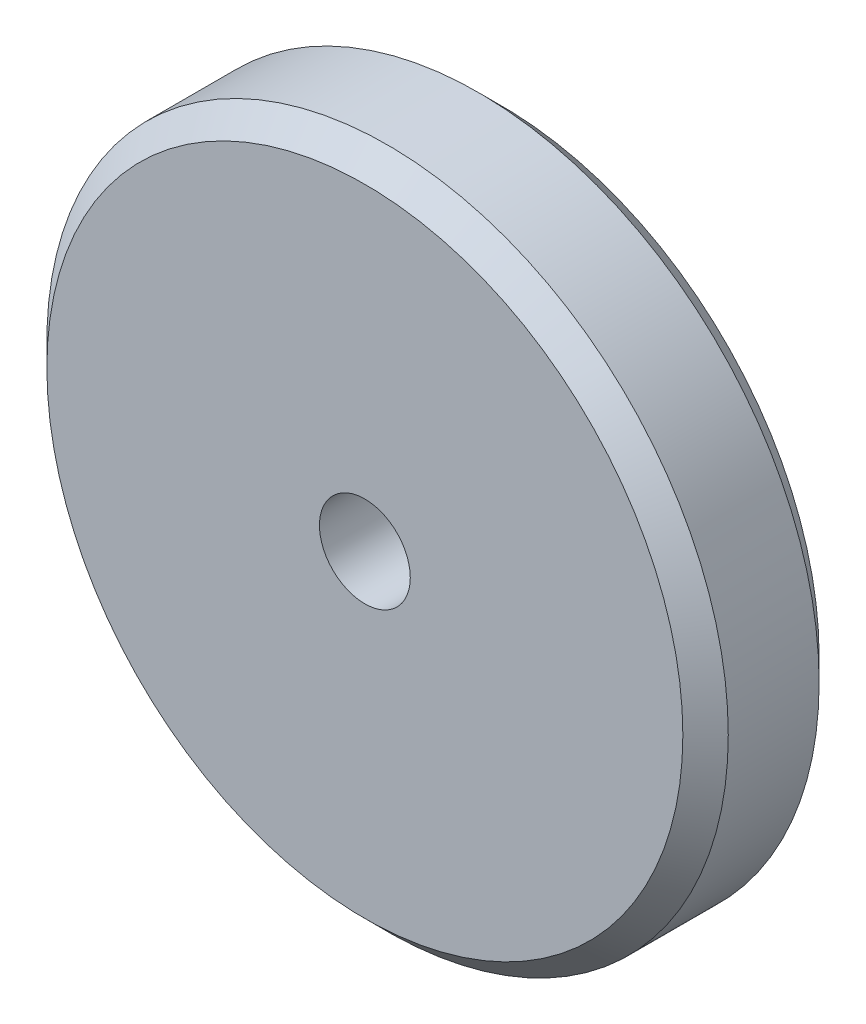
ISO-10303-21;
HEADER;
FILE_DESCRIPTION(('STEP AP214'),'2;1');
FILE_NAME('part.step','',(''),(''),'','','');
FILE_SCHEMA(('AUTOMOTIVE_DESIGN { 1 0 10303 214 1 1 1 1 }'));
ENDSEC;
DATA;
#1=APPLICATION_CONTEXT('core data for automotive mechanical design processes');
#2=APPLICATION_PROTOCOL_DEFINITION('international standard','automotive_design',2000,#1);
#3=PRODUCT_CONTEXT('',#1,'mechanical');
#4=PRODUCT('Part','Part','',(#3));
#5=PRODUCT_RELATED_PRODUCT_CATEGORY('part','',(#4));
#6=PRODUCT_DEFINITION_FORMATION('','',#4);
#7=PRODUCT_DEFINITION_CONTEXT('part definition',#1,'design');
#8=PRODUCT_DEFINITION('design','',#6,#7);
#9=PRODUCT_DEFINITION_SHAPE('','',#8);
#10=(LENGTH_UNIT() NAMED_UNIT(*) SI_UNIT(.MILLI.,.METRE.));
#11=(NAMED_UNIT(*) PLANE_ANGLE_UNIT() SI_UNIT($,.RADIAN.));
#12=(NAMED_UNIT(*) SI_UNIT($,.STERADIAN.) SOLID_ANGLE_UNIT());
#13=UNCERTAINTY_MEASURE_WITH_UNIT(LENGTH_MEASURE(1.E-05),#10,'distance_accuracy_value','');
#14=(GEOMETRIC_REPRESENTATION_CONTEXT(3) GLOBAL_UNCERTAINTY_ASSIGNED_CONTEXT((#13)) GLOBAL_UNIT_ASSIGNED_CONTEXT((#10,
#11,#12)) REPRESENTATION_CONTEXT('',''));
#15=CARTESIAN_POINT('',(0.,0.,0.));
#16=DIRECTION('',(0.,0.,1.));
#17=DIRECTION('',(1.,0.,0.));
#18=AXIS2_PLACEMENT_3D('',#15,#16,#17);
#19=CARTESIAN_POINT('',(0.,0.,6.));
#20=DIRECTION('',(0.,0.,1.));
#21=DIRECTION('',(1.,0.,0.));
#22=AXIS2_PLACEMENT_3D('',#19,#20,#21);
#23=PLANE('',#22);
#24=CARTESIAN_POINT('',(0.,0.,6.));
#25=DIRECTION('',(0.,0.,1.));
#26=DIRECTION('',(1.,0.,0.));
#27=AXIS2_PLACEMENT_3D('',#24,#25,#26);
#28=CIRCLE('',#27,14.);
#29=CARTESIAN_POINT('',(14.,0.,6.));
#30=VERTEX_POINT('',#29);
#31=EDGE_CURVE('E10',#30,#30,#28,.T.);
#32=ORIENTED_EDGE('',*,*,#31,.T.);
#33=EDGE_LOOP('',(#32));
#34=FACE_BOUND('',#33,.T.);
#35=CARTESIAN_POINT('',(0.,0.,6.));
#36=DIRECTION('',(0.,0.,1.));
#37=DIRECTION('',(1.,0.,0.));
#38=AXIS2_PLACEMENT_3D('',#35,#36,#37);
#39=CIRCLE('',#38,2.);
#40=CARTESIAN_POINT('',(2.,0.,6.));
#41=VERTEX_POINT('',#40);
#42=EDGE_CURVE('E52',#41,#41,#39,.T.);
#43=ORIENTED_EDGE('',*,*,#42,.F.);
#44=EDGE_LOOP('',(#43));
#45=FACE_BOUND('',#44,.T.);
#46=ADVANCED_FACE('F32',(#34,#45),#23,.T.);
#47=CARTESIAN_POINT('',(0.,0.,0.));
#48=DIRECTION('',(0.,0.,1.));
#49=DIRECTION('',(1.,0.,0.));
#50=AXIS2_PLACEMENT_3D('',#47,#48,#49);
#51=PLANE('',#50);
#52=CARTESIAN_POINT('',(0.,0.,0.));
#53=DIRECTION('',(0.,0.,1.));
#54=DIRECTION('',(1.,0.,0.));
#55=AXIS2_PLACEMENT_3D('',#52,#53,#54);
#56=CIRCLE('',#55,14.);
#57=CARTESIAN_POINT('',(14.,0.,0.));
#58=VERTEX_POINT('',#57);
#59=EDGE_CURVE('E39',#58,#58,#56,.F.);
#60=ORIENTED_EDGE('',*,*,#59,.T.);
#61=EDGE_LOOP('',(#60));
#62=FACE_BOUND('',#61,.T.);
#63=CARTESIAN_POINT('',(0.,0.,0.));
#64=DIRECTION('',(0.,0.,1.));
#65=DIRECTION('',(1.,0.,0.));
#66=AXIS2_PLACEMENT_3D('',#63,#64,#65);
#67=CIRCLE('',#66,2.);
#68=CARTESIAN_POINT('',(2.,0.,0.));
#69=VERTEX_POINT('',#68);
#70=EDGE_CURVE('E55',#69,#69,#67,.T.);
#71=ORIENTED_EDGE('',*,*,#70,.T.);
#72=EDGE_LOOP('',(#71));
#73=FACE_BOUND('',#72,.T.);
#74=ADVANCED_FACE('F59',(#62,#73),#51,.F.);
#75=CARTESIAN_POINT('',(0.,0.,6.));
#76=DIRECTION('',(0.,0.,-1.));
#77=DIRECTION('',(-1.,0.,0.));
#78=AXIS2_PLACEMENT_3D('',#75,#76,#77);
#79=CYLINDRICAL_SURFACE('',#78,15.);
#80=CARTESIAN_POINT('',(0.,0.,0.999999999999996));
#81=DIRECTION('',(0.,0.,1.));
#82=DIRECTION('',(1.,0.,0.));
#83=AXIS2_PLACEMENT_3D('',#80,#81,#82);
#84=CIRCLE('',#83,15.);
#85=CARTESIAN_POINT('',(15.,0.,0.999999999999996));
#86=VERTEX_POINT('',#85);
#87=EDGE_CURVE('E43',#86,#86,#84,.T.);
#88=ORIENTED_EDGE('',*,*,#87,.T.);
#89=EDGE_LOOP('',(#88));
#90=FACE_BOUND('',#89,.T.);
#91=CARTESIAN_POINT('',(0.,0.,4.99999999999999));
#92=DIRECTION('',(0.,0.,1.));
#93=DIRECTION('',(1.,0.,0.));
#94=AXIS2_PLACEMENT_3D('',#91,#92,#93);
#95=CIRCLE('',#94,15.);
#96=CARTESIAN_POINT('',(15.,0.,4.99999999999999));
#97=VERTEX_POINT('',#96);
#98=EDGE_CURVE('E47',#97,#97,#95,.F.);
#99=ORIENTED_EDGE('',*,*,#98,.T.);
#100=EDGE_LOOP('',(#99));
#101=FACE_BOUND('',#100,.T.);
#102=ADVANCED_FACE('F34',(#90,#101),#79,.T.);
#103=CARTESIAN_POINT('',(0.,0.,6.));
#104=DIRECTION('',(0.,0.,-1.));
#105=DIRECTION('',(-1.,0.,0.));
#106=AXIS2_PLACEMENT_3D('',#103,#104,#105);
#107=CYLINDRICAL_SURFACE('',#106,2.);
#108=ORIENTED_EDGE('',*,*,#42,.T.);
#109=EDGE_LOOP('',(#108));
#110=FACE_BOUND('',#109,.T.);
#111=ORIENTED_EDGE('',*,*,#70,.F.);
#112=EDGE_LOOP('',(#111));
#113=FACE_BOUND('',#112,.T.);
#114=ADVANCED_FACE('F61',(#110,#113),#107,.F.);
#115=CARTESIAN_POINT('',(0.,0.,0.999999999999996));
#116=DIRECTION('',(0.,0.,1.));
#117=DIRECTION('',(1.,0.,0.));
#118=AXIS2_PLACEMENT_3D('',#115,#116,#117);
#119=CONICAL_SURFACE('',#118,15.,0.785398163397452);
#120=ORIENTED_EDGE('',*,*,#59,.F.);
#121=EDGE_LOOP('',(#120));
#122=FACE_BOUND('',#121,.T.);
#123=ORIENTED_EDGE('',*,*,#87,.F.);
#124=EDGE_LOOP('',(#123));
#125=FACE_BOUND('',#124,.T.);
#126=ADVANCED_FACE('F63',(#122,#125),#119,.T.);
#127=CARTESIAN_POINT('',(0.,0.,6.));
#128=DIRECTION('',(0.,0.,-1.));
#129=DIRECTION('',(-1.,0.,0.));
#130=AXIS2_PLACEMENT_3D('',#127,#128,#129);
#131=CONICAL_SURFACE('',#130,14.,0.785398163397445);
#132=ORIENTED_EDGE('',*,*,#98,.F.);
#133=EDGE_LOOP('',(#132));
#134=FACE_BOUND('',#133,.T.);
#135=ORIENTED_EDGE('',*,*,#31,.F.);
#136=EDGE_LOOP('',(#135));
#137=FACE_BOUND('',#136,.T.);
#138=ADVANCED_FACE('F70',(#134,#137),#131,.T.);
#139=CLOSED_SHELL('',(#46,#74,#102,#114,#126,#138));
#140=MANIFOLD_SOLID_BREP('B2',#139);
#141=ADVANCED_BREP_SHAPE_REPRESENTATION('',(#18,#140),#14);
#142=SHAPE_DEFINITION_REPRESENTATION(#9,#141);
ENDSEC;
END-ISO-10303-21;
